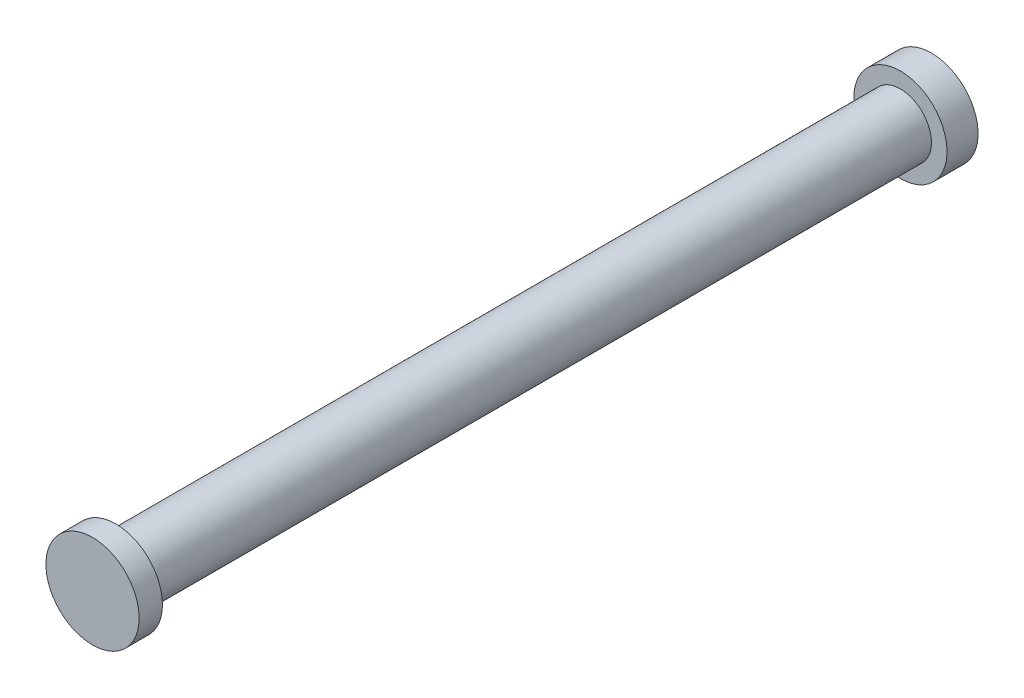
from build123d import *

# Parameters (mm, degrees)
SKETCH1_R           = 6
BOSS_EXTRUDE1_DEPTH = 3
SKETCH2_R           = 4
BOSS_EXTRUDE2_DEPTH = 101
BOSS_EXTRUDE3_START = 4
SKETCH3_R           = 6
BOSS_EXTRUDE3_DEPTH = 4


with BuildPart() as part:
    # Sketch1 → Boss-Extrude1 (new body)
    with BuildSketch(Plane.XY):
        Circle(SKETCH1_R)
    extrude(amount=BOSS_EXTRUDE1_DEPTH)

    # Sketch2 → Boss-Extrude2 (add)
    with BuildSketch(Plane(origin=(0, 0, 0), x_dir=(-1, 0, 0), z_dir=(0, 0, -1))):
        Circle(SKETCH2_R)
    extrude(amount=BOSS_EXTRUDE2_DEPTH)

    # Sketch3 → Boss-Extrude3 (add)
    with BuildSketch(Plane(origin=(0, 0, -101), x_dir=(-1, 0, 0), z_dir=(0, 0, -1)).offset(BOSS_EXTRUDE3_START)):
        with Locations(Location((0, 0, 0), (0, 0, 180))):
            Circle(SKETCH3_R)
    extrude(amount=-BOSS_EXTRUDE3_DEPTH)


solid = part.part
